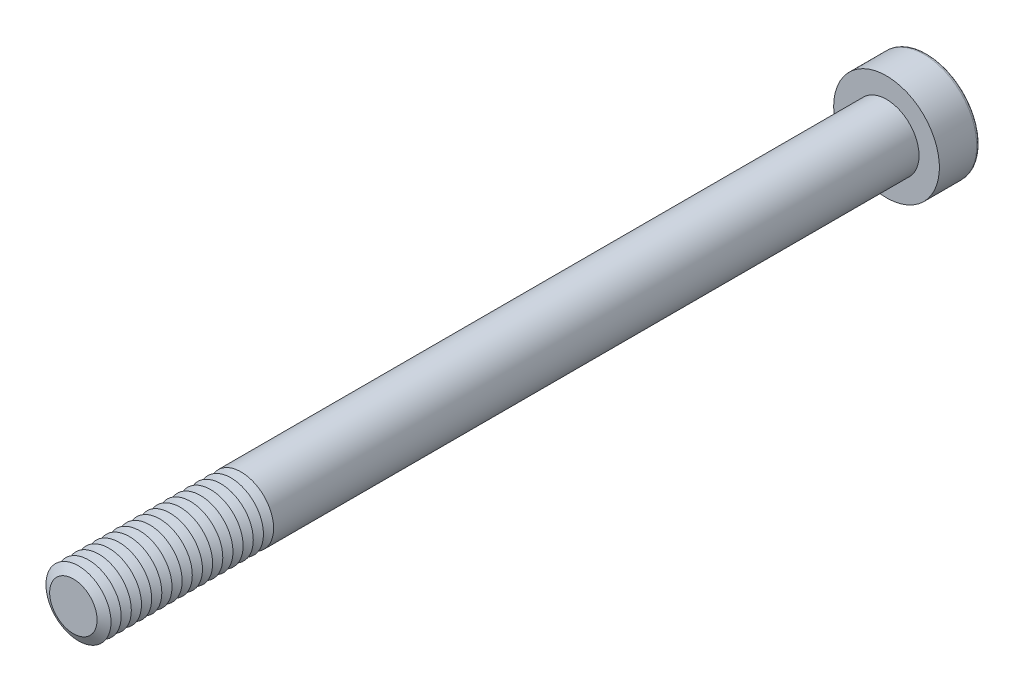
ISO-10303-21;
HEADER;
FILE_DESCRIPTION(('STEP AP214'),'2;1');
FILE_NAME('part.step','',(''),(''),'','','');
FILE_SCHEMA(('AUTOMOTIVE_DESIGN { 1 0 10303 214 1 1 1 1 }'));
ENDSEC;
DATA;
#1=APPLICATION_CONTEXT('core data for automotive mechanical design processes');
#2=APPLICATION_PROTOCOL_DEFINITION('international standard','automotive_design',2000,#1);
#3=PRODUCT_CONTEXT('',#1,'mechanical');
#4=PRODUCT('Part','Part','',(#3));
#5=PRODUCT_RELATED_PRODUCT_CATEGORY('part','',(#4));
#6=PRODUCT_DEFINITION_FORMATION('','',#4);
#7=PRODUCT_DEFINITION_CONTEXT('part definition',#1,'design');
#8=PRODUCT_DEFINITION('design','',#6,#7);
#9=PRODUCT_DEFINITION_SHAPE('','',#8);
#10=(LENGTH_UNIT() NAMED_UNIT(*) SI_UNIT(.MILLI.,.METRE.));
#11=(NAMED_UNIT(*) PLANE_ANGLE_UNIT() SI_UNIT($,.RADIAN.));
#12=(NAMED_UNIT(*) SI_UNIT($,.STERADIAN.) SOLID_ANGLE_UNIT());
#13=UNCERTAINTY_MEASURE_WITH_UNIT(LENGTH_MEASURE(1.E-05),#10,'distance_accuracy_value','');
#14=(GEOMETRIC_REPRESENTATION_CONTEXT(3) GLOBAL_UNCERTAINTY_ASSIGNED_CONTEXT((#13)) GLOBAL_UNIT_ASSIGNED_CONTEXT((#10,
#11,#12)) REPRESENTATION_CONTEXT('',''));
#15=CARTESIAN_POINT('',(0.,0.,0.));
#16=DIRECTION('',(0.,0.,1.));
#17=DIRECTION('',(1.,0.,0.));
#18=AXIS2_PLACEMENT_3D('',#15,#16,#17);
#19=CARTESIAN_POINT('',(0.,0.,95.625));
#20=DIRECTION('',(0.,0.,1.));
#21=DIRECTION('',(1.,0.,0.));
#22=AXIS2_PLACEMENT_3D('',#19,#20,#21);
#23=CONICAL_SURFACE('',#22,4.,1.0471975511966);
#24=CARTESIAN_POINT('',(0.,0.,95.));
#25=DIRECTION('',(0.,0.,1.));
#26=DIRECTION('',(1.,0.,0.));
#27=AXIS2_PLACEMENT_3D('',#24,#25,#26);
#28=CIRCLE('',#27,2.91746824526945);
#29=CARTESIAN_POINT('',(2.91746824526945,0.,95.));
#30=VERTEX_POINT('',#29);
#31=EDGE_CURVE('E312',#30,#30,#28,.T.);
#32=ORIENTED_EDGE('',*,*,#31,.T.);
#33=EDGE_LOOP('',(#32));
#34=FACE_BOUND('',#33,.T.);
#35=CARTESIAN_POINT('',(0.,0.,95.625));
#36=DIRECTION('',(0.,0.,1.));
#37=DIRECTION('',(1.,0.,0.));
#38=AXIS2_PLACEMENT_3D('',#35,#36,#37);
#39=CIRCLE('',#38,4.);
#40=CARTESIAN_POINT('',(4.,0.,95.625));
#41=VERTEX_POINT('',#40);
#42=EDGE_CURVE('E315',#41,#41,#39,.T.);
#43=ORIENTED_EDGE('',*,*,#42,.F.);
#44=EDGE_LOOP('',(#43));
#45=FACE_BOUND('',#44,.T.);
#46=ADVANCED_FACE('F39',(#34,#45),#23,.T.);
#47=CARTESIAN_POINT('',(0.,0.,95.));
#48=DIRECTION('',(0.,0.,-1.));
#49=DIRECTION('',(-1.,0.,0.));
#50=AXIS2_PLACEMENT_3D('',#47,#48,#49);
#51=CONICAL_SURFACE('',#50,2.91746824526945,1.0471975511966);
#52=CARTESIAN_POINT('',(0.,0.,94.375));
#53=DIRECTION('',(0.,0.,1.));
#54=DIRECTION('',(1.,0.,0.));
#55=AXIS2_PLACEMENT_3D('',#52,#53,#54);
#56=CIRCLE('',#55,4.);
#57=CARTESIAN_POINT('',(4.,0.,94.375));
#58=VERTEX_POINT('',#57);
#59=EDGE_CURVE('E323',#58,#58,#56,.T.);
#60=ORIENTED_EDGE('',*,*,#59,.T.);
#61=EDGE_LOOP('',(#60));
#62=FACE_BOUND('',#61,.T.);
#63=ORIENTED_EDGE('',*,*,#31,.F.);
#64=EDGE_LOOP('',(#63));
#65=FACE_BOUND('',#64,.T.);
#66=ADVANCED_FACE('F243',(#62,#65),#51,.T.);
#67=CARTESIAN_POINT('',(0.,0.,100.));
#68=DIRECTION('',(0.,0.,1.));
#69=DIRECTION('',(1.,0.,0.));
#70=AXIS2_PLACEMENT_3D('',#67,#68,#69);
#71=PLANE('',#70);
#72=CARTESIAN_POINT('',(0.,0.,100.));
#73=DIRECTION('',(0.,0.,1.));
#74=DIRECTION('',(1.,0.,0.));
#75=AXIS2_PLACEMENT_3D('',#72,#73,#74);
#76=CIRCLE('',#75,2.91746824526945);
#77=CARTESIAN_POINT('',(2.91746824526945,0.,100.));
#78=VERTEX_POINT('',#77);
#79=EDGE_CURVE('E172',#78,#78,#76,.T.);
#80=ORIENTED_EDGE('',*,*,#79,.T.);
#81=EDGE_LOOP('',(#80));
#82=FACE_BOUND('',#81,.T.);
#83=ADVANCED_FACE('F249',(#82),#71,.T.);
#84=CARTESIAN_POINT('',(0.,0.,100.));
#85=DIRECTION('',(0.,0.,-1.));
#86=DIRECTION('',(-1.,0.,0.));
#87=AXIS2_PLACEMENT_3D('',#84,#85,#86);
#88=CONICAL_SURFACE('',#87,2.91746824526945,1.0471975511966);
#89=CARTESIAN_POINT('',(0.,0.,99.375));
#90=DIRECTION('',(0.,0.,1.));
#91=DIRECTION('',(1.,0.,0.));
#92=AXIS2_PLACEMENT_3D('',#89,#90,#91);
#93=CIRCLE('',#92,4.);
#94=CARTESIAN_POINT('',(4.,0.,99.375));
#95=VERTEX_POINT('',#94);
#96=EDGE_CURVE('E289',#95,#95,#93,.T.);
#97=ORIENTED_EDGE('',*,*,#96,.T.);
#98=EDGE_LOOP('',(#97));
#99=FACE_BOUND('',#98,.T.);
#100=ORIENTED_EDGE('',*,*,#79,.F.);
#101=EDGE_LOOP('',(#100));
#102=FACE_BOUND('',#101,.T.);
#103=ADVANCED_FACE('F197',(#99,#102),#88,.T.);
#104=CARTESIAN_POINT('',(0.,0.,99.375));
#105=DIRECTION('',(0.,0.,1.));
#106=DIRECTION('',(1.,0.,0.));
#107=AXIS2_PLACEMENT_3D('',#104,#105,#106);
#108=CONICAL_SURFACE('',#107,4.,1.0471975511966);
#109=CARTESIAN_POINT('',(0.,0.,98.75));
#110=DIRECTION('',(0.,0.,1.));
#111=DIRECTION('',(1.,0.,0.));
#112=AXIS2_PLACEMENT_3D('',#109,#110,#111);
#113=CIRCLE('',#112,2.91746824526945);
#114=CARTESIAN_POINT('',(2.91746824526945,0.,98.75));
#115=VERTEX_POINT('',#114);
#116=EDGE_CURVE('E286',#115,#115,#113,.T.);
#117=ORIENTED_EDGE('',*,*,#116,.T.);
#118=EDGE_LOOP('',(#117));
#119=FACE_BOUND('',#118,.T.);
#120=ORIENTED_EDGE('',*,*,#96,.F.);
#121=EDGE_LOOP('',(#120));
#122=FACE_BOUND('',#121,.T.);
#123=ADVANCED_FACE('F275',(#119,#122),#108,.T.);
#124=CARTESIAN_POINT('',(0.,0.,98.75));
#125=DIRECTION('',(0.,0.,-1.));
#126=DIRECTION('',(-1.,0.,0.));
#127=AXIS2_PLACEMENT_3D('',#124,#125,#126);
#128=CONICAL_SURFACE('',#127,2.91746824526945,1.0471975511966);
#129=CARTESIAN_POINT('',(0.,0.,98.125));
#130=DIRECTION('',(0.,0.,1.));
#131=DIRECTION('',(1.,0.,0.));
#132=AXIS2_PLACEMENT_3D('',#129,#130,#131);
#133=CIRCLE('',#132,4.);
#134=CARTESIAN_POINT('',(4.,0.,98.125));
#135=VERTEX_POINT('',#134);
#136=EDGE_CURVE('E298',#135,#135,#133,.T.);
#137=ORIENTED_EDGE('',*,*,#136,.T.);
#138=EDGE_LOOP('',(#137));
#139=FACE_BOUND('',#138,.T.);
#140=ORIENTED_EDGE('',*,*,#116,.F.);
#141=EDGE_LOOP('',(#140));
#142=FACE_BOUND('',#141,.T.);
#143=ADVANCED_FACE('F272',(#139,#142),#128,.T.);
#144=CARTESIAN_POINT('',(0.,0.,98.125));
#145=DIRECTION('',(0.,0.,1.));
#146=DIRECTION('',(1.,0.,0.));
#147=AXIS2_PLACEMENT_3D('',#144,#145,#146);
#148=CONICAL_SURFACE('',#147,4.,1.0471975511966);
#149=CARTESIAN_POINT('',(0.,0.,97.5));
#150=DIRECTION('',(0.,0.,1.));
#151=DIRECTION('',(1.,0.,0.));
#152=AXIS2_PLACEMENT_3D('',#149,#150,#151);
#153=CIRCLE('',#152,2.91746824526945);
#154=CARTESIAN_POINT('',(2.91746824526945,0.,97.5));
#155=VERTEX_POINT('',#154);
#156=EDGE_CURVE('E291',#155,#155,#153,.T.);
#157=ORIENTED_EDGE('',*,*,#156,.T.);
#158=EDGE_LOOP('',(#157));
#159=FACE_BOUND('',#158,.T.);
#160=ORIENTED_EDGE('',*,*,#136,.F.);
#161=EDGE_LOOP('',(#160));
#162=FACE_BOUND('',#161,.T.);
#163=ADVANCED_FACE('F268',(#159,#162),#148,.T.);
#164=CARTESIAN_POINT('',(0.,0.,97.5));
#165=DIRECTION('',(0.,0.,-1.));
#166=DIRECTION('',(-1.,0.,0.));
#167=AXIS2_PLACEMENT_3D('',#164,#165,#166);
#168=CONICAL_SURFACE('',#167,2.91746824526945,1.0471975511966);
#169=CARTESIAN_POINT('',(0.,0.,96.875));
#170=DIRECTION('',(0.,0.,1.));
#171=DIRECTION('',(1.,0.,0.));
#172=AXIS2_PLACEMENT_3D('',#169,#170,#171);
#173=CIRCLE('',#172,4.);
#174=CARTESIAN_POINT('',(4.,0.,96.875));
#175=VERTEX_POINT('',#174);
#176=EDGE_CURVE('E308',#175,#175,#173,.T.);
#177=ORIENTED_EDGE('',*,*,#176,.T.);
#178=EDGE_LOOP('',(#177));
#179=FACE_BOUND('',#178,.T.);
#180=ORIENTED_EDGE('',*,*,#156,.F.);
#181=EDGE_LOOP('',(#180));
#182=FACE_BOUND('',#181,.T.);
#183=ADVANCED_FACE('F264',(#179,#182),#168,.T.);
#184=CARTESIAN_POINT('',(0.,0.,96.875));
#185=DIRECTION('',(0.,0.,1.));
#186=DIRECTION('',(1.,0.,0.));
#187=AXIS2_PLACEMENT_3D('',#184,#185,#186);
#188=CONICAL_SURFACE('',#187,4.,1.0471975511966);
#189=CARTESIAN_POINT('',(0.,0.,96.25));
#190=DIRECTION('',(0.,0.,1.));
#191=DIRECTION('',(1.,0.,0.));
#192=AXIS2_PLACEMENT_3D('',#189,#190,#191);
#193=CIRCLE('',#192,2.91746824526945);
#194=CARTESIAN_POINT('',(2.91746824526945,0.,96.25));
#195=VERTEX_POINT('',#194);
#196=EDGE_CURVE('E304',#195,#195,#193,.T.);
#197=ORIENTED_EDGE('',*,*,#196,.T.);
#198=EDGE_LOOP('',(#197));
#199=FACE_BOUND('',#198,.T.);
#200=ORIENTED_EDGE('',*,*,#176,.F.);
#201=EDGE_LOOP('',(#200));
#202=FACE_BOUND('',#201,.T.);
#203=ADVANCED_FACE('F260',(#199,#202),#188,.T.);
#204=CARTESIAN_POINT('',(0.,0.,96.25));
#205=DIRECTION('',(0.,0.,-1.));
#206=DIRECTION('',(-1.,0.,0.));
#207=AXIS2_PLACEMENT_3D('',#204,#205,#206);
#208=CONICAL_SURFACE('',#207,2.91746824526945,1.0471975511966);
#209=ORIENTED_EDGE('',*,*,#42,.T.);
#210=EDGE_LOOP('',(#209));
#211=FACE_BOUND('',#210,.T.);
#212=ORIENTED_EDGE('',*,*,#196,.F.);
#213=EDGE_LOOP('',(#212));
#214=FACE_BOUND('',#213,.T.);
#215=ADVANCED_FACE('F256',(#211,#214),#208,.T.);
#216=CARTESIAN_POINT('',(0.,0.,94.375));
#217=DIRECTION('',(0.,0.,1.));
#218=DIRECTION('',(1.,0.,0.));
#219=AXIS2_PLACEMENT_3D('',#216,#217,#218);
#220=CONICAL_SURFACE('',#219,4.,1.0471975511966);
#221=CARTESIAN_POINT('',(0.,0.,93.75));
#222=DIRECTION('',(0.,0.,1.));
#223=DIRECTION('',(1.,0.,0.));
#224=AXIS2_PLACEMENT_3D('',#221,#222,#223);
#225=CIRCLE('',#224,2.91746824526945);
#226=CARTESIAN_POINT('',(2.91746824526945,0.,93.75));
#227=VERTEX_POINT('',#226);
#228=EDGE_CURVE('E319',#227,#227,#225,.T.);
#229=ORIENTED_EDGE('',*,*,#228,.T.);
#230=EDGE_LOOP('',(#229));
#231=FACE_BOUND('',#230,.T.);
#232=ORIENTED_EDGE('',*,*,#59,.F.);
#233=EDGE_LOOP('',(#232));
#234=FACE_BOUND('',#233,.T.);
#235=ADVANCED_FACE('F259',(#231,#234),#220,.T.);
#236=CARTESIAN_POINT('',(0.,0.,93.75));
#237=DIRECTION('',(0.,0.,-1.));
#238=DIRECTION('',(-1.,0.,0.));
#239=AXIS2_PLACEMENT_3D('',#236,#237,#238);
#240=CONICAL_SURFACE('',#239,2.91746824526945,1.0471975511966);
#241=CARTESIAN_POINT('',(0.,0.,93.125));
#242=DIRECTION('',(0.,0.,1.));
#243=DIRECTION('',(1.,0.,0.));
#244=AXIS2_PLACEMENT_3D('',#241,#242,#243);
#245=CIRCLE('',#244,4.);
#246=CARTESIAN_POINT('',(4.,0.,93.125));
#247=VERTEX_POINT('',#246);
#248=EDGE_CURVE('E331',#247,#247,#245,.T.);
#249=ORIENTED_EDGE('',*,*,#248,.T.);
#250=EDGE_LOOP('',(#249));
#251=FACE_BOUND('',#250,.T.);
#252=ORIENTED_EDGE('',*,*,#228,.F.);
#253=EDGE_LOOP('',(#252));
#254=FACE_BOUND('',#253,.T.);
#255=ADVANCED_FACE('F510',(#251,#254),#240,.T.);
#256=CARTESIAN_POINT('',(0.,0.,93.125));
#257=DIRECTION('',(0.,0.,1.));
#258=DIRECTION('',(1.,0.,0.));
#259=AXIS2_PLACEMENT_3D('',#256,#257,#258);
#260=CONICAL_SURFACE('',#259,4.,1.0471975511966);
#261=CARTESIAN_POINT('',(0.,0.,92.5));
#262=DIRECTION('',(0.,0.,1.));
#263=DIRECTION('',(1.,0.,0.));
#264=AXIS2_PLACEMENT_3D('',#261,#262,#263);
#265=CIRCLE('',#264,2.91746824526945);
#266=CARTESIAN_POINT('',(2.91746824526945,0.,92.5));
#267=VERTEX_POINT('',#266);
#268=EDGE_CURVE('E327',#267,#267,#265,.T.);
#269=ORIENTED_EDGE('',*,*,#268,.T.);
#270=EDGE_LOOP('',(#269));
#271=FACE_BOUND('',#270,.T.);
#272=ORIENTED_EDGE('',*,*,#248,.F.);
#273=EDGE_LOOP('',(#272));
#274=FACE_BOUND('',#273,.T.);
#275=ADVANCED_FACE('F506',(#271,#274),#260,.T.);
#276=CARTESIAN_POINT('',(0.,0.,92.5));
#277=DIRECTION('',(0.,0.,-1.));
#278=DIRECTION('',(-1.,0.,0.));
#279=AXIS2_PLACEMENT_3D('',#276,#277,#278);
#280=CONICAL_SURFACE('',#279,2.91746824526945,1.0471975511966);
#281=CARTESIAN_POINT('',(0.,0.,91.875));
#282=DIRECTION('',(0.,0.,1.));
#283=DIRECTION('',(1.,0.,0.));
#284=AXIS2_PLACEMENT_3D('',#281,#282,#283);
#285=CIRCLE('',#284,4.);
#286=CARTESIAN_POINT('',(4.,0.,91.875));
#287=VERTEX_POINT('',#286);
#288=EDGE_CURVE('E339',#287,#287,#285,.T.);
#289=ORIENTED_EDGE('',*,*,#288,.T.);
#290=EDGE_LOOP('',(#289));
#291=FACE_BOUND('',#290,.T.);
#292=ORIENTED_EDGE('',*,*,#268,.F.);
#293=EDGE_LOOP('',(#292));
#294=FACE_BOUND('',#293,.T.);
#295=ADVANCED_FACE('F502',(#291,#294),#280,.T.);
#296=CARTESIAN_POINT('',(0.,0.,91.875));
#297=DIRECTION('',(0.,0.,1.));
#298=DIRECTION('',(1.,0.,0.));
#299=AXIS2_PLACEMENT_3D('',#296,#297,#298);
#300=CONICAL_SURFACE('',#299,4.,1.0471975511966);
#301=CARTESIAN_POINT('',(0.,0.,91.25));
#302=DIRECTION('',(0.,0.,1.));
#303=DIRECTION('',(1.,0.,0.));
#304=AXIS2_PLACEMENT_3D('',#301,#302,#303);
#305=CIRCLE('',#304,2.91746824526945);
#306=CARTESIAN_POINT('',(2.91746824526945,0.,91.25));
#307=VERTEX_POINT('',#306);
#308=EDGE_CURVE('E335',#307,#307,#305,.T.);
#309=ORIENTED_EDGE('',*,*,#308,.T.);
#310=EDGE_LOOP('',(#309));
#311=FACE_BOUND('',#310,.T.);
#312=ORIENTED_EDGE('',*,*,#288,.F.);
#313=EDGE_LOOP('',(#312));
#314=FACE_BOUND('',#313,.T.);
#315=ADVANCED_FACE('F498',(#311,#314),#300,.T.);
#316=CARTESIAN_POINT('',(0.,0.,91.25));
#317=DIRECTION('',(0.,0.,-1.));
#318=DIRECTION('',(-1.,0.,0.));
#319=AXIS2_PLACEMENT_3D('',#316,#317,#318);
#320=CONICAL_SURFACE('',#319,2.91746824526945,1.0471975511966);
#321=CARTESIAN_POINT('',(0.,0.,90.625));
#322=DIRECTION('',(0.,0.,1.));
#323=DIRECTION('',(1.,0.,0.));
#324=AXIS2_PLACEMENT_3D('',#321,#322,#323);
#325=CIRCLE('',#324,4.);
#326=CARTESIAN_POINT('',(4.,0.,90.625));
#327=VERTEX_POINT('',#326);
#328=EDGE_CURVE('E347',#327,#327,#325,.T.);
#329=ORIENTED_EDGE('',*,*,#328,.T.);
#330=EDGE_LOOP('',(#329));
#331=FACE_BOUND('',#330,.T.);
#332=ORIENTED_EDGE('',*,*,#308,.F.);
#333=EDGE_LOOP('',(#332));
#334=FACE_BOUND('',#333,.T.);
#335=ADVANCED_FACE('F494',(#331,#334),#320,.T.);
#336=CARTESIAN_POINT('',(0.,0.,90.625));
#337=DIRECTION('',(0.,0.,1.));
#338=DIRECTION('',(1.,0.,0.));
#339=AXIS2_PLACEMENT_3D('',#336,#337,#338);
#340=CONICAL_SURFACE('',#339,4.,1.0471975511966);
#341=CARTESIAN_POINT('',(0.,0.,90.));
#342=DIRECTION('',(0.,0.,1.));
#343=DIRECTION('',(1.,0.,0.));
#344=AXIS2_PLACEMENT_3D('',#341,#342,#343);
#345=CIRCLE('',#344,2.91746824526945);
#346=CARTESIAN_POINT('',(2.91746824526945,0.,90.));
#347=VERTEX_POINT('',#346);
#348=EDGE_CURVE('E343',#347,#347,#345,.T.);
#349=ORIENTED_EDGE('',*,*,#348,.T.);
#350=EDGE_LOOP('',(#349));
#351=FACE_BOUND('',#350,.T.);
#352=ORIENTED_EDGE('',*,*,#328,.F.);
#353=EDGE_LOOP('',(#352));
#354=FACE_BOUND('',#353,.T.);
#355=ADVANCED_FACE('F490',(#351,#354),#340,.T.);
#356=CARTESIAN_POINT('',(0.,0.,90.));
#357=DIRECTION('',(0.,0.,-1.));
#358=DIRECTION('',(-1.,0.,0.));
#359=AXIS2_PLACEMENT_3D('',#356,#357,#358);
#360=CONICAL_SURFACE('',#359,2.91746824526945,1.0471975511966);
#361=CARTESIAN_POINT('',(0.,0.,89.375));
#362=DIRECTION('',(0.,0.,1.));
#363=DIRECTION('',(1.,0.,0.));
#364=AXIS2_PLACEMENT_3D('',#361,#362,#363);
#365=CIRCLE('',#364,4.);
#366=CARTESIAN_POINT('',(4.,0.,89.375));
#367=VERTEX_POINT('',#366);
#368=EDGE_CURVE('E355',#367,#367,#365,.T.);
#369=ORIENTED_EDGE('',*,*,#368,.T.);
#370=EDGE_LOOP('',(#369));
#371=FACE_BOUND('',#370,.T.);
#372=ORIENTED_EDGE('',*,*,#348,.F.);
#373=EDGE_LOOP('',(#372));
#374=FACE_BOUND('',#373,.T.);
#375=ADVANCED_FACE('F486',(#371,#374),#360,.T.);
#376=CARTESIAN_POINT('',(0.,0.,89.375));
#377=DIRECTION('',(0.,0.,1.));
#378=DIRECTION('',(1.,0.,0.));
#379=AXIS2_PLACEMENT_3D('',#376,#377,#378);
#380=CONICAL_SURFACE('',#379,4.,1.0471975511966);
#381=CARTESIAN_POINT('',(0.,0.,88.75));
#382=DIRECTION('',(0.,0.,1.));
#383=DIRECTION('',(1.,0.,0.));
#384=AXIS2_PLACEMENT_3D('',#381,#382,#383);
#385=CIRCLE('',#384,2.91746824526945);
#386=CARTESIAN_POINT('',(2.91746824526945,0.,88.75));
#387=VERTEX_POINT('',#386);
#388=EDGE_CURVE('E351',#387,#387,#385,.T.);
#389=ORIENTED_EDGE('',*,*,#388,.T.);
#390=EDGE_LOOP('',(#389));
#391=FACE_BOUND('',#390,.T.);
#392=ORIENTED_EDGE('',*,*,#368,.F.);
#393=EDGE_LOOP('',(#392));
#394=FACE_BOUND('',#393,.T.);
#395=ADVANCED_FACE('F482',(#391,#394),#380,.T.);
#396=CARTESIAN_POINT('',(0.,0.,88.75));
#397=DIRECTION('',(0.,0.,-1.));
#398=DIRECTION('',(-1.,0.,0.));
#399=AXIS2_PLACEMENT_3D('',#396,#397,#398);
#400=CONICAL_SURFACE('',#399,2.91746824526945,1.0471975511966);
#401=CARTESIAN_POINT('',(0.,0.,88.125));
#402=DIRECTION('',(0.,0.,1.));
#403=DIRECTION('',(1.,0.,0.));
#404=AXIS2_PLACEMENT_3D('',#401,#402,#403);
#405=CIRCLE('',#404,4.);
#406=CARTESIAN_POINT('',(4.,0.,88.125));
#407=VERTEX_POINT('',#406);
#408=EDGE_CURVE('E363',#407,#407,#405,.T.);
#409=ORIENTED_EDGE('',*,*,#408,.T.);
#410=EDGE_LOOP('',(#409));
#411=FACE_BOUND('',#410,.T.);
#412=ORIENTED_EDGE('',*,*,#388,.F.);
#413=EDGE_LOOP('',(#412));
#414=FACE_BOUND('',#413,.T.);
#415=ADVANCED_FACE('F478',(#411,#414),#400,.T.);
#416=CARTESIAN_POINT('',(0.,0.,88.125));
#417=DIRECTION('',(0.,0.,1.));
#418=DIRECTION('',(1.,0.,0.));
#419=AXIS2_PLACEMENT_3D('',#416,#417,#418);
#420=CONICAL_SURFACE('',#419,4.,1.0471975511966);
#421=CARTESIAN_POINT('',(0.,0.,87.5));
#422=DIRECTION('',(0.,0.,1.));
#423=DIRECTION('',(1.,0.,0.));
#424=AXIS2_PLACEMENT_3D('',#421,#422,#423);
#425=CIRCLE('',#424,2.91746824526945);
#426=CARTESIAN_POINT('',(2.91746824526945,0.,87.5));
#427=VERTEX_POINT('',#426);
#428=EDGE_CURVE('E359',#427,#427,#425,.T.);
#429=ORIENTED_EDGE('',*,*,#428,.T.);
#430=EDGE_LOOP('',(#429));
#431=FACE_BOUND('',#430,.T.);
#432=ORIENTED_EDGE('',*,*,#408,.F.);
#433=EDGE_LOOP('',(#432));
#434=FACE_BOUND('',#433,.T.);
#435=ADVANCED_FACE('F474',(#431,#434),#420,.T.);
#436=CARTESIAN_POINT('',(0.,0.,87.5));
#437=DIRECTION('',(0.,0.,-1.));
#438=DIRECTION('',(-1.,0.,0.));
#439=AXIS2_PLACEMENT_3D('',#436,#437,#438);
#440=CONICAL_SURFACE('',#439,2.91746824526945,1.0471975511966);
#441=CARTESIAN_POINT('',(0.,0.,86.875));
#442=DIRECTION('',(0.,0.,1.));
#443=DIRECTION('',(1.,0.,0.));
#444=AXIS2_PLACEMENT_3D('',#441,#442,#443);
#445=CIRCLE('',#444,4.);
#446=CARTESIAN_POINT('',(4.,0.,86.875));
#447=VERTEX_POINT('',#446);
#448=EDGE_CURVE('E371',#447,#447,#445,.T.);
#449=ORIENTED_EDGE('',*,*,#448,.T.);
#450=EDGE_LOOP('',(#449));
#451=FACE_BOUND('',#450,.T.);
#452=ORIENTED_EDGE('',*,*,#428,.F.);
#453=EDGE_LOOP('',(#452));
#454=FACE_BOUND('',#453,.T.);
#455=ADVANCED_FACE('F470',(#451,#454),#440,.T.);
#456=CARTESIAN_POINT('',(0.,0.,86.875));
#457=DIRECTION('',(0.,0.,1.));
#458=DIRECTION('',(1.,0.,0.));
#459=AXIS2_PLACEMENT_3D('',#456,#457,#458);
#460=CONICAL_SURFACE('',#459,4.,1.0471975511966);
#461=CARTESIAN_POINT('',(0.,0.,86.25));
#462=DIRECTION('',(0.,0.,1.));
#463=DIRECTION('',(1.,0.,0.));
#464=AXIS2_PLACEMENT_3D('',#461,#462,#463);
#465=CIRCLE('',#464,2.91746824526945);
#466=CARTESIAN_POINT('',(2.91746824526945,0.,86.25));
#467=VERTEX_POINT('',#466);
#468=EDGE_CURVE('E367',#467,#467,#465,.T.);
#469=ORIENTED_EDGE('',*,*,#468,.T.);
#470=EDGE_LOOP('',(#469));
#471=FACE_BOUND('',#470,.T.);
#472=ORIENTED_EDGE('',*,*,#448,.F.);
#473=EDGE_LOOP('',(#472));
#474=FACE_BOUND('',#473,.T.);
#475=ADVANCED_FACE('F466',(#471,#474),#460,.T.);
#476=CARTESIAN_POINT('',(0.,0.,86.25));
#477=DIRECTION('',(0.,0.,-1.));
#478=DIRECTION('',(-1.,0.,0.));
#479=AXIS2_PLACEMENT_3D('',#476,#477,#478);
#480=CONICAL_SURFACE('',#479,2.91746824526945,1.0471975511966);
#481=CARTESIAN_POINT('',(0.,0.,85.625));
#482=DIRECTION('',(0.,0.,1.));
#483=DIRECTION('',(1.,0.,0.));
#484=AXIS2_PLACEMENT_3D('',#481,#482,#483);
#485=CIRCLE('',#484,4.);
#486=CARTESIAN_POINT('',(4.,0.,85.625));
#487=VERTEX_POINT('',#486);
#488=EDGE_CURVE('E379',#487,#487,#485,.T.);
#489=ORIENTED_EDGE('',*,*,#488,.T.);
#490=EDGE_LOOP('',(#489));
#491=FACE_BOUND('',#490,.T.);
#492=ORIENTED_EDGE('',*,*,#468,.F.);
#493=EDGE_LOOP('',(#492));
#494=FACE_BOUND('',#493,.T.);
#495=ADVANCED_FACE('F462',(#491,#494),#480,.T.);
#496=CARTESIAN_POINT('',(0.,0.,85.625));
#497=DIRECTION('',(0.,0.,1.));
#498=DIRECTION('',(1.,0.,0.));
#499=AXIS2_PLACEMENT_3D('',#496,#497,#498);
#500=CONICAL_SURFACE('',#499,4.,1.0471975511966);
#501=CARTESIAN_POINT('',(0.,0.,85.));
#502=DIRECTION('',(0.,0.,1.));
#503=DIRECTION('',(1.,0.,0.));
#504=AXIS2_PLACEMENT_3D('',#501,#502,#503);
#505=CIRCLE('',#504,2.91746824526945);
#506=CARTESIAN_POINT('',(2.91746824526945,0.,85.));
#507=VERTEX_POINT('',#506);
#508=EDGE_CURVE('E375',#507,#507,#505,.T.);
#509=ORIENTED_EDGE('',*,*,#508,.T.);
#510=EDGE_LOOP('',(#509));
#511=FACE_BOUND('',#510,.T.);
#512=ORIENTED_EDGE('',*,*,#488,.F.);
#513=EDGE_LOOP('',(#512));
#514=FACE_BOUND('',#513,.T.);
#515=ADVANCED_FACE('F458',(#511,#514),#500,.T.);
#516=CARTESIAN_POINT('',(0.,0.,85.));
#517=DIRECTION('',(0.,0.,-1.));
#518=DIRECTION('',(-1.,0.,0.));
#519=AXIS2_PLACEMENT_3D('',#516,#517,#518);
#520=CONICAL_SURFACE('',#519,2.91746824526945,1.0471975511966);
#521=CARTESIAN_POINT('',(0.,0.,84.375));
#522=DIRECTION('',(0.,0.,1.));
#523=DIRECTION('',(1.,0.,0.));
#524=AXIS2_PLACEMENT_3D('',#521,#522,#523);
#525=CIRCLE('',#524,4.);
#526=CARTESIAN_POINT('',(4.,0.,84.375));
#527=VERTEX_POINT('',#526);
#528=EDGE_CURVE('E387',#527,#527,#525,.T.);
#529=ORIENTED_EDGE('',*,*,#528,.T.);
#530=EDGE_LOOP('',(#529));
#531=FACE_BOUND('',#530,.T.);
#532=ORIENTED_EDGE('',*,*,#508,.F.);
#533=EDGE_LOOP('',(#532));
#534=FACE_BOUND('',#533,.T.);
#535=ADVANCED_FACE('F454',(#531,#534),#520,.T.);
#536=CARTESIAN_POINT('',(0.,0.,84.375));
#537=DIRECTION('',(0.,0.,1.));
#538=DIRECTION('',(1.,0.,0.));
#539=AXIS2_PLACEMENT_3D('',#536,#537,#538);
#540=CONICAL_SURFACE('',#539,4.,1.0471975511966);
#541=CARTESIAN_POINT('',(0.,0.,83.75));
#542=DIRECTION('',(0.,0.,1.));
#543=DIRECTION('',(1.,0.,0.));
#544=AXIS2_PLACEMENT_3D('',#541,#542,#543);
#545=CIRCLE('',#544,2.91746824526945);
#546=CARTESIAN_POINT('',(2.91746824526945,0.,83.75));
#547=VERTEX_POINT('',#546);
#548=EDGE_CURVE('E383',#547,#547,#545,.T.);
#549=ORIENTED_EDGE('',*,*,#548,.T.);
#550=EDGE_LOOP('',(#549));
#551=FACE_BOUND('',#550,.T.);
#552=ORIENTED_EDGE('',*,*,#528,.F.);
#553=EDGE_LOOP('',(#552));
#554=FACE_BOUND('',#553,.T.);
#555=ADVANCED_FACE('F450',(#551,#554),#540,.T.);
#556=CARTESIAN_POINT('',(0.,0.,83.75));
#557=DIRECTION('',(0.,0.,-1.));
#558=DIRECTION('',(-1.,0.,0.));
#559=AXIS2_PLACEMENT_3D('',#556,#557,#558);
#560=CONICAL_SURFACE('',#559,2.91746824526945,1.0471975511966);
#561=CARTESIAN_POINT('',(0.,0.,83.125));
#562=DIRECTION('',(0.,0.,1.));
#563=DIRECTION('',(1.,0.,0.));
#564=AXIS2_PLACEMENT_3D('',#561,#562,#563);
#565=CIRCLE('',#564,4.);
#566=CARTESIAN_POINT('',(4.,0.,83.125));
#567=VERTEX_POINT('',#566);
#568=EDGE_CURVE('E394',#567,#567,#565,.T.);
#569=ORIENTED_EDGE('',*,*,#568,.T.);
#570=EDGE_LOOP('',(#569));
#571=FACE_BOUND('',#570,.T.);
#572=ORIENTED_EDGE('',*,*,#548,.F.);
#573=EDGE_LOOP('',(#572));
#574=FACE_BOUND('',#573,.T.);
#575=ADVANCED_FACE('F446',(#571,#574),#560,.T.);
#576=CARTESIAN_POINT('',(0.,0.,83.125));
#577=DIRECTION('',(0.,0.,1.));
#578=DIRECTION('',(1.,0.,0.));
#579=AXIS2_PLACEMENT_3D('',#576,#577,#578);
#580=CONICAL_SURFACE('',#579,4.,1.0471975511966);
#581=CARTESIAN_POINT('',(0.,0.,82.5));
#582=DIRECTION('',(0.,0.,1.));
#583=DIRECTION('',(1.,0.,0.));
#584=AXIS2_PLACEMENT_3D('',#581,#582,#583);
#585=CIRCLE('',#584,2.91746824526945);
#586=CARTESIAN_POINT('',(2.91746824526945,0.,82.5));
#587=VERTEX_POINT('',#586);
#588=EDGE_CURVE('E391',#587,#587,#585,.T.);
#589=ORIENTED_EDGE('',*,*,#588,.T.);
#590=EDGE_LOOP('',(#589));
#591=FACE_BOUND('',#590,.T.);
#592=ORIENTED_EDGE('',*,*,#568,.F.);
#593=EDGE_LOOP('',(#592));
#594=FACE_BOUND('',#593,.T.);
#595=ADVANCED_FACE('F442',(#591,#594),#580,.T.);
#596=CARTESIAN_POINT('',(0.,0.,82.5));
#597=DIRECTION('',(0.,0.,-1.));
#598=DIRECTION('',(-1.,0.,0.));
#599=AXIS2_PLACEMENT_3D('',#596,#597,#598);
#600=CONICAL_SURFACE('',#599,2.91746824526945,1.0471975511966);
#601=CARTESIAN_POINT('',(0.,0.,81.875));
#602=DIRECTION('',(0.,0.,1.));
#603=DIRECTION('',(1.,0.,0.));
#604=AXIS2_PLACEMENT_3D('',#601,#602,#603);
#605=CIRCLE('',#604,4.);
#606=CARTESIAN_POINT('',(4.,0.,81.875));
#607=VERTEX_POINT('',#606);
#608=EDGE_CURVE('E402',#607,#607,#605,.T.);
#609=ORIENTED_EDGE('',*,*,#608,.T.);
#610=EDGE_LOOP('',(#609));
#611=FACE_BOUND('',#610,.T.);
#612=ORIENTED_EDGE('',*,*,#588,.F.);
#613=EDGE_LOOP('',(#612));
#614=FACE_BOUND('',#613,.T.);
#615=ADVANCED_FACE('F438',(#611,#614),#600,.T.);
#616=CARTESIAN_POINT('',(0.,0.,81.875));
#617=DIRECTION('',(0.,0.,1.));
#618=DIRECTION('',(1.,0.,0.));
#619=AXIS2_PLACEMENT_3D('',#616,#617,#618);
#620=CONICAL_SURFACE('',#619,4.,1.0471975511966);
#621=CARTESIAN_POINT('',(0.,0.,81.25));
#622=DIRECTION('',(0.,0.,1.));
#623=DIRECTION('',(1.,0.,0.));
#624=AXIS2_PLACEMENT_3D('',#621,#622,#623);
#625=CIRCLE('',#624,2.91746824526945);
#626=CARTESIAN_POINT('',(2.91746824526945,0.,81.25));
#627=VERTEX_POINT('',#626);
#628=EDGE_CURVE('E398',#627,#627,#625,.T.);
#629=ORIENTED_EDGE('',*,*,#628,.T.);
#630=EDGE_LOOP('',(#629));
#631=FACE_BOUND('',#630,.T.);
#632=ORIENTED_EDGE('',*,*,#608,.F.);
#633=EDGE_LOOP('',(#632));
#634=FACE_BOUND('',#633,.T.);
#635=ADVANCED_FACE('F433',(#631,#634),#620,.T.);
#636=CARTESIAN_POINT('',(0.,0.,81.25));
#637=DIRECTION('',(0.,0.,-1.));
#638=DIRECTION('',(-1.,0.,0.));
#639=AXIS2_PLACEMENT_3D('',#636,#637,#638);
#640=CONICAL_SURFACE('',#639,2.91746824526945,1.0471975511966);
#641=CARTESIAN_POINT('',(0.,0.,80.625));
#642=DIRECTION('',(0.,0.,1.));
#643=DIRECTION('',(1.,0.,0.));
#644=AXIS2_PLACEMENT_3D('',#641,#642,#643);
#645=CIRCLE('',#644,4.);
#646=CARTESIAN_POINT('',(4.,0.,80.625));
#647=VERTEX_POINT('',#646);
#648=EDGE_CURVE('E414',#647,#647,#645,.T.);
#649=ORIENTED_EDGE('',*,*,#648,.T.);
#650=EDGE_LOOP('',(#649));
#651=FACE_BOUND('',#650,.T.);
#652=ORIENTED_EDGE('',*,*,#628,.F.);
#653=EDGE_LOOP('',(#652));
#654=FACE_BOUND('',#653,.T.);
#655=ADVANCED_FACE('F419',(#651,#654),#640,.T.);
#656=CARTESIAN_POINT('',(0.,0.,80.625));
#657=DIRECTION('',(0.,0.,1.));
#658=DIRECTION('',(1.,0.,0.));
#659=AXIS2_PLACEMENT_3D('',#656,#657,#658);
#660=CONICAL_SURFACE('',#659,4.,1.0471975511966);
#661=CARTESIAN_POINT('',(0.,0.,80.));
#662=DIRECTION('',(0.,0.,1.));
#663=DIRECTION('',(1.,0.,0.));
#664=AXIS2_PLACEMENT_3D('',#661,#662,#663);
#665=CIRCLE('',#664,2.91746824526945);
#666=CARTESIAN_POINT('',(2.91746824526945,0.,80.));
#667=VERTEX_POINT('',#666);
#668=EDGE_CURVE('E406',#667,#667,#665,.T.);
#669=ORIENTED_EDGE('',*,*,#668,.T.);
#670=EDGE_LOOP('',(#669));
#671=FACE_BOUND('',#670,.T.);
#672=ORIENTED_EDGE('',*,*,#648,.F.);
#673=EDGE_LOOP('',(#672));
#674=FACE_BOUND('',#673,.T.);
#675=ADVANCED_FACE('F422',(#671,#674),#660,.T.);
#676=CARTESIAN_POINT('',(0.,0.,80.));
#677=DIRECTION('',(0.,0.,-1.));
#678=DIRECTION('',(-1.,0.,0.));
#679=AXIS2_PLACEMENT_3D('',#676,#677,#678);
#680=CONICAL_SURFACE('',#679,2.91746824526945,1.0471975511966);
#681=CARTESIAN_POINT('',(0.,0.,79.375));
#682=DIRECTION('',(0.,0.,1.));
#683=DIRECTION('',(1.,0.,0.));
#684=AXIS2_PLACEMENT_3D('',#681,#682,#683);
#685=CIRCLE('',#684,4.);
#686=CARTESIAN_POINT('',(4.,0.,79.375));
#687=VERTEX_POINT('',#686);
#688=EDGE_CURVE('E410',#687,#687,#685,.T.);
#689=ORIENTED_EDGE('',*,*,#688,.T.);
#690=EDGE_LOOP('',(#689));
#691=FACE_BOUND('',#690,.T.);
#692=ORIENTED_EDGE('',*,*,#668,.F.);
#693=EDGE_LOOP('',(#692));
#694=FACE_BOUND('',#693,.T.);
#695=ADVANCED_FACE('F424',(#691,#694),#680,.T.);
#696=CARTESIAN_POINT('',(0.,0.,-1.25));
#697=DIRECTION('',(0.,0.,-1.));
#698=DIRECTION('',(-1.,0.,0.));
#699=AXIS2_PLACEMENT_3D('',#696,#697,#698);
#700=CONICAL_SURFACE('',#699,2.5,1.0471975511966);
#701=CARTESIAN_POINT('',(0.,0.,0.193375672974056));
#702=VERTEX_POINT('',#701);
#703=VERTEX_LOOP('',#702);
#704=FACE_BOUND('',#703,.T.);
#705=CARTESIAN_POINT('',(0.,0.,-1.25));
#706=DIRECTION('',(0.,0.,-1.));
#707=DIRECTION('',(-1.,0.,0.));
#708=AXIS2_PLACEMENT_3D('',#705,#706,#707);
#709=CIRCLE('',#708,2.5);
#710=CARTESIAN_POINT('',(-2.1650635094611,1.25,-1.25));
#711=VERTEX_POINT('',#710);
#712=CARTESIAN_POINT('',(0.,2.5,-1.25));
#713=VERTEX_POINT('',#712);
#714=EDGE_CURVE('E149',#711,#713,#709,.T.);
#715=ORIENTED_EDGE('',*,*,#714,.T.);
#716=CARTESIAN_POINT('',(0.,0.,-1.25));
#717=DIRECTION('',(0.,0.,-1.));
#718=DIRECTION('',(-1.,0.,0.));
#719=AXIS2_PLACEMENT_3D('',#716,#717,#718);
#720=CIRCLE('',#719,2.5);
#721=CARTESIAN_POINT('',(2.1650635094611,1.25,-1.25));
#722=VERTEX_POINT('',#721);
#723=EDGE_CURVE('E54',#713,#722,#720,.T.);
#724=ORIENTED_EDGE('',*,*,#723,.T.);
#725=CARTESIAN_POINT('',(2.1650635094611,-1.25,-1.25));
#726=VERTEX_POINT('',#725);
#727=EDGE_CURVE('E1027',#722,#726,#720,.T.);
#728=ORIENTED_EDGE('',*,*,#727,.T.);
#729=CARTESIAN_POINT('',(0.,-2.5,-1.25));
#730=VERTEX_POINT('',#729);
#731=EDGE_CURVE('E1026',#726,#730,#720,.T.);
#732=ORIENTED_EDGE('',*,*,#731,.T.);
#733=CARTESIAN_POINT('',(-2.1650635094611,-1.25,-1.25));
#734=VERTEX_POINT('',#733);
#735=EDGE_CURVE('E1019',#730,#734,#720,.T.);
#736=ORIENTED_EDGE('',*,*,#735,.T.);
#737=EDGE_CURVE('E1017',#734,#711,#720,.T.);
#738=ORIENTED_EDGE('',*,*,#737,.T.);
#739=EDGE_LOOP('',(#715,#724,#728,#732,#736,#738));
#740=FACE_BOUND('',#739,.T.);
#741=ADVANCED_FACE('F199',(#704,#740),#700,.F.);
#742=CARTESIAN_POINT('',(0.,0.,-1.25));
#743=DIRECTION('',(0.,0.,-1.));
#744=DIRECTION('',(-1.,0.,0.));
#745=AXIS2_PLACEMENT_3D('',#742,#743,#744);
#746=PLANE('',#745);
#747=ORIENTED_EDGE('',*,*,#723,.F.);
#748=DIRECTION('',(1.,0.,0.));
#749=VECTOR('',#748,1.);
#750=CARTESIAN_POINT('',(-1.44337567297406,2.5,-1.25));
#751=LINE('',#750,#749);
#752=CARTESIAN_POINT('',(1.44337567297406,2.5,-1.25));
#753=VERTEX_POINT('',#752);
#754=EDGE_CURVE('E1070',#713,#753,#751,.T.);
#755=ORIENTED_EDGE('',*,*,#754,.T.);
#756=DIRECTION('',(0.5,-0.866025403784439,0.));
#757=VECTOR('',#756,1.);
#758=CARTESIAN_POINT('',(1.44337567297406,2.5,-1.25));
#759=LINE('',#758,#757);
#760=EDGE_CURVE('E155',#753,#722,#759,.T.);
#761=ORIENTED_EDGE('',*,*,#760,.T.);
#762=EDGE_LOOP('',(#747,#755,#761));
#763=FACE_BOUND('',#762,.T.);
#764=ADVANCED_FACE('F605',(#763),#746,.T.);
#765=ORIENTED_EDGE('',*,*,#727,.F.);
#766=CARTESIAN_POINT('',(2.88675134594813,0.,-1.25));
#767=VERTEX_POINT('',#766);
#768=EDGE_CURVE('E1064',#722,#767,#759,.T.);
#769=ORIENTED_EDGE('',*,*,#768,.T.);
#770=DIRECTION('',(-0.5,-0.866025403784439,0.));
#771=VECTOR('',#770,1.);
#772=CARTESIAN_POINT('',(2.88675134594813,0.,-1.25));
#773=LINE('',#772,#771);
#774=EDGE_CURVE('E1039',#767,#726,#773,.T.);
#775=ORIENTED_EDGE('',*,*,#774,.T.);
#776=EDGE_LOOP('',(#765,#769,#775));
#777=FACE_BOUND('',#776,.T.);
#778=ADVANCED_FACE('F615',(#777),#746,.T.);
#779=ORIENTED_EDGE('',*,*,#731,.F.);
#780=CARTESIAN_POINT('',(1.44337567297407,-2.5,-1.25));
#781=VERTEX_POINT('',#780);
#782=EDGE_CURVE('E1041',#726,#781,#773,.T.);
#783=ORIENTED_EDGE('',*,*,#782,.T.);
#784=DIRECTION('',(-1.,0.,0.));
#785=VECTOR('',#784,1.);
#786=CARTESIAN_POINT('',(1.44337567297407,-2.5,-1.25));
#787=LINE('',#786,#785);
#788=EDGE_CURVE('E992',#781,#730,#787,.T.);
#789=ORIENTED_EDGE('',*,*,#788,.T.);
#790=EDGE_LOOP('',(#779,#783,#789));
#791=FACE_BOUND('',#790,.T.);
#792=ADVANCED_FACE('F625',(#791),#746,.T.);
#793=ORIENTED_EDGE('',*,*,#735,.F.);
#794=CARTESIAN_POINT('',(-1.44337567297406,-2.5,-1.25));
#795=VERTEX_POINT('',#794);
#796=EDGE_CURVE('E1035',#730,#795,#787,.T.);
#797=ORIENTED_EDGE('',*,*,#796,.T.);
#798=DIRECTION('',(-0.5,0.866025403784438,0.));
#799=VECTOR('',#798,1.);
#800=CARTESIAN_POINT('',(-1.44337567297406,-2.5,-1.25));
#801=LINE('',#800,#799);
#802=EDGE_CURVE('E1037',#795,#734,#801,.T.);
#803=ORIENTED_EDGE('',*,*,#802,.T.);
#804=EDGE_LOOP('',(#793,#797,#803));
#805=FACE_BOUND('',#804,.T.);
#806=ADVANCED_FACE('F633',(#805),#746,.T.);
#807=ORIENTED_EDGE('',*,*,#737,.F.);
#808=CARTESIAN_POINT('',(-2.88675134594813,0.,-1.25));
#809=VERTEX_POINT('',#808);
#810=EDGE_CURVE('E1043',#734,#809,#801,.T.);
#811=ORIENTED_EDGE('',*,*,#810,.T.);
#812=DIRECTION('',(0.5,0.866025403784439,0.));
#813=VECTOR('',#812,1.);
#814=CARTESIAN_POINT('',(-2.88675134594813,0.,-1.25));
#815=LINE('',#814,#813);
#816=EDGE_CURVE('E158',#809,#711,#815,.T.);
#817=ORIENTED_EDGE('',*,*,#816,.T.);
#818=EDGE_LOOP('',(#807,#811,#817));
#819=FACE_BOUND('',#818,.T.);
#820=ADVANCED_FACE('F229',(#819),#746,.T.);
#821=ORIENTED_EDGE('',*,*,#714,.F.);
#822=CARTESIAN_POINT('',(-1.44337567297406,2.5,-1.25));
#823=VERTEX_POINT('',#822);
#824=EDGE_CURVE('E1050',#711,#823,#815,.T.);
#825=ORIENTED_EDGE('',*,*,#824,.T.);
#826=EDGE_CURVE('E1067',#823,#713,#751,.T.);
#827=ORIENTED_EDGE('',*,*,#826,.T.);
#828=EDGE_LOOP('',(#821,#825,#827));
#829=FACE_BOUND('',#828,.T.);
#830=ADVANCED_FACE('F617',(#829),#746,.T.);
#831=CARTESIAN_POINT('',(-1.44337567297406,2.5,-1.25));
#832=DIRECTION('',(0.,1.,0.));
#833=DIRECTION('',(-1.,0.,0.));
#834=AXIS2_PLACEMENT_3D('',#831,#832,#833);
#835=PLANE('',#834);
#836=DIRECTION('',(0.,0.,-1.));
#837=VECTOR('',#836,1.);
#838=CARTESIAN_POINT('',(-1.44337567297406,2.5,-1.25));
#839=LINE('',#838,#837);
#840=CARTESIAN_POINT('',(-1.44337567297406,2.5,-5.));
#841=VERTEX_POINT('',#840);
#842=EDGE_CURVE('E147',#823,#841,#839,.T.);
#843=ORIENTED_EDGE('',*,*,#842,.T.);
#844=CARTESIAN_POINT('',(-3.76800948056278,2.5,-5.43814611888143));
#845=CARTESIAN_POINT('',(-3.65512241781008,2.5,-5.41294788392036));
#846=CARTESIAN_POINT('',(-3.54216337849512,2.5,-5.38806689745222));
#847=CARTESIAN_POINT('',(-3.31606595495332,2.5,-5.33910944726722));
#848=CARTESIAN_POINT('',(-3.202927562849,2.5,-5.31503301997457));
#849=CARTESIAN_POINT('',(-2.97632910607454,2.5,-5.26783262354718));
#850=CARTESIAN_POINT('',(-2.86286882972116,2.5,-5.24470966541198));
#851=CARTESIAN_POINT('',(-2.63570880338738,2.5,-5.19967851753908));
#852=CARTESIAN_POINT('',(-2.522009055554,2.5,-5.17777031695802));
#853=CARTESIAN_POINT('',(-2.18246936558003,2.5,-5.11464083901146));
#854=CARTESIAN_POINT('',(-1.95621666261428,2.5,-5.07559469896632));
#855=CARTESIAN_POINT('',(-1.50233128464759,2.5,-5.00642421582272));
#856=CARTESIAN_POINT('',(-1.27469889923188,2.5,-4.97629806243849));
#857=CARTESIAN_POINT('',(-0.930935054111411,2.5,-4.9407375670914));
#858=CARTESIAN_POINT('',(-0.815306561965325,2.5,-4.93045885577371));
#859=CARTESIAN_POINT('',(-0.583775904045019,2.5,-4.91374261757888));
#860=CARTESIAN_POINT('',(-0.467873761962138,2.5,-4.9073047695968));
#861=CARTESIAN_POINT('',(-0.235955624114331,2.5,-4.89864425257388));
#862=CARTESIAN_POINT('',(-0.119939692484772,2.5,-4.89641989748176));
#863=CARTESIAN_POINT('',(0.11209426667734,2.5,-4.89632233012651));
#864=CARTESIAN_POINT('',(0.228112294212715,2.5,-4.89844912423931));
#865=CARTESIAN_POINT('',(0.460464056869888,2.5,-4.90693624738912));
#866=CARTESIAN_POINT('',(0.576797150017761,2.5,-4.91331380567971));
#867=CARTESIAN_POINT('',(0.809186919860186,2.5,-4.92994602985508));
#868=CARTESIAN_POINT('',(0.925243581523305,2.5,-4.94020090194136));
#869=CARTESIAN_POINT('',(1.1570783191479,2.5,-4.96408095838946));
#870=CARTESIAN_POINT('',(1.27285617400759,2.5,-4.97770825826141));
#871=CARTESIAN_POINT('',(1.50403978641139,2.5,-5.0077859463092));
#872=CARTESIAN_POINT('',(1.61944554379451,2.5,-5.02423633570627));
#873=CARTESIAN_POINT('',(1.97116037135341,2.5,-5.07794848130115));
#874=CARTESIAN_POINT('',(2.20690405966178,2.5,-5.11889404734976));
#875=CARTESIAN_POINT('',(2.67723558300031,2.5,-5.2069642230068));
#876=CARTESIAN_POINT('',(2.9118232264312,2.5,-5.25408982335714));
#877=CARTESIAN_POINT('',(3.38022088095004,2.5,-5.35235327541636));
#878=CARTESIAN_POINT('',(3.61403064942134,2.5,-5.40349227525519));
#879=CARTESIAN_POINT('',(4.08105387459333,2.5,-5.50842823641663));
#880=CARTESIAN_POINT('',(4.31426731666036,2.5,-5.56222526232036));
#881=CARTESIAN_POINT('',(4.77742011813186,2.5,-5.67097662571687));
#882=CARTESIAN_POINT('',(5.00736469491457,2.5,-5.72590882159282));
#883=CARTESIAN_POINT('',(5.46695141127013,2.5,-5.83704335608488));
#884=CARTESIAN_POINT('',(5.69659354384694,2.5,-5.89324572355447));
#885=CARTESIAN_POINT('',(6.15532898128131,2.5,-6.00649703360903));
#886=CARTESIAN_POINT('',(6.3844226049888,2.5,-6.06354468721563));
#887=CARTESIAN_POINT('',(6.84242442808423,2.5,-6.17834514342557));
#888=CARTESIAN_POINT('',(7.07133263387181,2.5,-6.23609792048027));
#889=CARTESIAN_POINT('',(7.30017784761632,2.5,-6.29409642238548));
#890=B_SPLINE_CURVE_WITH_KNOTS('',3,(#844,#845,#846,#847,#848,#849,#850,#851,#852,#853,#854,
#855,#856,#857,#858,#859,#860,#861,#862,#863,#864,#865,#866,#867,#868,#869,#870,#871,#872,#873,
#874,#875,#876,#877,#878,#879,#880,#881,#882,#883,#884,#885,#886,#887,#888,#889),.UNSPECIFIED.,
.F.,.F.,(4,2,2,2,2,2,2,2,2,2,2,2,2,2,2,2,2,2,2,2,2,2,4),(0.,0.346996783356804,0.694009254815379,
1.04138068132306,1.38874900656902,2.07743762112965,2.76598637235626,3.11418615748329,
3.46235682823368,3.81038814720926,4.15841997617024,4.50787110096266,4.85734081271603,
5.2070303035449,5.55671994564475,6.27438533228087,6.99216591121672,7.71015258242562,
8.42815670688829,9.13739674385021,9.84665290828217,10.5549206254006,11.2631627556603),.UNSPECIFIED.);
#891=CARTESIAN_POINT('',(1.44337567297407,2.5,-5.));
#892=VERTEX_POINT('',#891);
#893=EDGE_CURVE('E124',#841,#892,#890,.T.);
#894=ORIENTED_EDGE('',*,*,#893,.T.);
#895=DIRECTION('',(0.,0.,-1.));
#896=VECTOR('',#895,1.);
#897=CARTESIAN_POINT('',(1.44337567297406,2.5,-1.25));
#898=LINE('',#897,#896);
#899=EDGE_CURVE('E143',#753,#892,#898,.T.);
#900=ORIENTED_EDGE('',*,*,#899,.F.);
#901=ORIENTED_EDGE('',*,*,#754,.F.);
#902=ORIENTED_EDGE('',*,*,#826,.F.);
#903=EDGE_LOOP('',(#843,#894,#900,#901,#902));
#904=FACE_BOUND('',#903,.T.);
#905=ADVANCED_FACE('F141',(#904),#835,.F.);
#906=CARTESIAN_POINT('',(1.44337567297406,2.5,-1.25));
#907=DIRECTION('',(0.866025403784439,0.5,0.));
#908=DIRECTION('',(-0.5,0.866025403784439,0.));
#909=AXIS2_PLACEMENT_3D('',#906,#907,#908);
#910=PLANE('',#909);
#911=ORIENTED_EDGE('',*,*,#899,.T.);
#912=CARTESIAN_POINT('',(1.44326020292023,2.5002,-5.00003094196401));
#913=CARTESIAN_POINT('',(1.50320952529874,2.3963647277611,-4.98395956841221));
#914=CARTESIAN_POINT('',(1.56326755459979,2.29234116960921,-4.96936932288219));
#915=CARTESIAN_POINT('',(1.68359574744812,2.08392662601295,-4.94373552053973));
#916=CARTESIAN_POINT('',(1.7438659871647,1.97953550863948,-4.93269340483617));
#917=CARTESIAN_POINT('',(1.86425311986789,1.77101887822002,-4.91480059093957));
#918=CARTESIAN_POINT('',(1.9243691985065,1.66689477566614,-4.90792855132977));
#919=CARTESIAN_POINT('',(2.04467803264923,1.45851376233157,-4.89871383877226));
#920=CARTESIAN_POINT('',(2.10487077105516,1.35425688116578,-4.89637028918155));
#921=CARTESIAN_POINT('',(2.22525624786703,1.14574311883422,-4.89637028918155));
#922=CARTESIAN_POINT('',(2.28544898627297,1.04148623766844,-4.89871383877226));
#923=CARTESIAN_POINT('',(2.40575782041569,0.833105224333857,-4.90792855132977));
#924=CARTESIAN_POINT('',(2.4658738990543,0.728981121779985,-4.91480059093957));
#925=CARTESIAN_POINT('',(2.58626103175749,0.520464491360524,-4.93269340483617));
#926=CARTESIAN_POINT('',(2.64653127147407,0.416073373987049,-4.94373552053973));
#927=CARTESIAN_POINT('',(2.7668594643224,0.207658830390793,-4.96936932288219));
#928=CARTESIAN_POINT('',(2.82691749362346,0.103635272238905,-4.98395956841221));
#929=CARTESIAN_POINT('',(2.88686681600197,-0.000199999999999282,-5.00003094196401));
#930=B_SPLINE_CURVE_WITH_KNOTS('',3,(#912,#913,#914,#915,#916,#917,#918,#919,#920,#921,#922,
#923,#924,#925,#926,#927,#928,#929),.UNSPECIFIED.,.F.,.F.,(4,2,2,2,2,2,2,2,4),(0.,
0.362931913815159,0.726011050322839,1.08721601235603,1.44835104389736,1.80948607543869,
2.17069103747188,2.53377017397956,2.89670208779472),.UNSPECIFIED.);
#931=CARTESIAN_POINT('',(2.88675134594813,0.,-5.));
#932=VERTEX_POINT('',#931);
#933=EDGE_CURVE('E11',#892,#932,#930,.T.);
#934=ORIENTED_EDGE('',*,*,#933,.T.);
#935=DIRECTION('',(0.,0.,-1.));
#936=VECTOR('',#935,1.);
#937=CARTESIAN_POINT('',(2.88675134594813,0.,-1.25));
#938=LINE('',#937,#936);
#939=EDGE_CURVE('E157',#767,#932,#938,.T.);
#940=ORIENTED_EDGE('',*,*,#939,.F.);
#941=ORIENTED_EDGE('',*,*,#768,.F.);
#942=ORIENTED_EDGE('',*,*,#760,.F.);
#943=EDGE_LOOP('',(#911,#934,#940,#941,#942));
#944=FACE_BOUND('',#943,.T.);
#945=ADVANCED_FACE('F152',(#944),#910,.F.);
#946=CARTESIAN_POINT('',(2.88675134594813,0.,-1.25));
#947=DIRECTION('',(0.866025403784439,-0.5,0.));
#948=DIRECTION('',(0.5,0.866025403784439,0.));
#949=AXIS2_PLACEMENT_3D('',#946,#947,#948);
#950=PLANE('',#949);
#951=ORIENTED_EDGE('',*,*,#939,.T.);
#952=CARTESIAN_POINT('',(2.88686681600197,0.000200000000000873,-5.00003094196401));
#953=CARTESIAN_POINT('',(2.82691749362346,-0.103635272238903,-4.98395956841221));
#954=CARTESIAN_POINT('',(2.7668594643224,-0.207658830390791,-4.96936932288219));
#955=CARTESIAN_POINT('',(2.64653127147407,-0.416073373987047,-4.94373552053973));
#956=CARTESIAN_POINT('',(2.58626103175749,-0.520464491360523,-4.93269340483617));
#957=CARTESIAN_POINT('',(2.4658738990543,-0.728981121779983,-4.91480059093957));
#958=CARTESIAN_POINT('',(2.40575782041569,-0.833105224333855,-4.90792855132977));
#959=CARTESIAN_POINT('',(2.28544898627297,-1.04148623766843,-4.89871383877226));
#960=CARTESIAN_POINT('',(2.22525624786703,-1.14574311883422,-4.89637028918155));
#961=CARTESIAN_POINT('',(2.10487077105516,-1.35425688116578,-4.89637028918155));
#962=CARTESIAN_POINT('',(2.04467803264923,-1.45851376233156,-4.89871383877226));
#963=CARTESIAN_POINT('',(1.9243691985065,-1.66689477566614,-4.90792855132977));
#964=CARTESIAN_POINT('',(1.86425311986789,-1.77101887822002,-4.91480059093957));
#965=CARTESIAN_POINT('',(1.74386598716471,-1.97953550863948,-4.93269340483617));
#966=CARTESIAN_POINT('',(1.68359574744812,-2.08392662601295,-4.94373552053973));
#967=CARTESIAN_POINT('',(1.56326755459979,-2.29234116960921,-4.96936932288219));
#968=CARTESIAN_POINT('',(1.50320952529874,-2.3963647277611,-4.98395956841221));
#969=CARTESIAN_POINT('',(1.44326020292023,-2.5002,-5.00003094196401));
#970=B_SPLINE_CURVE_WITH_KNOTS('',3,(#952,#953,#954,#955,#956,#957,#958,#959,#960,#961,#962,
#963,#964,#965,#966,#967,#968,#969),.UNSPECIFIED.,.F.,.F.,(4,2,2,2,2,2,2,2,4),(0.,
0.362931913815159,0.726011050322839,1.08721601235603,1.44835104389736,1.80948607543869,
2.17069103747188,2.53377017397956,2.89670208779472),.UNSPECIFIED.);
#971=CARTESIAN_POINT('',(1.44337567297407,-2.5,-5.));
#972=VERTEX_POINT('',#971);
#973=EDGE_CURVE('E171',#932,#972,#970,.T.);
#974=ORIENTED_EDGE('',*,*,#973,.T.);
#975=DIRECTION('',(0.,0.,-1.));
#976=VECTOR('',#975,1.);
#977=CARTESIAN_POINT('',(1.44337567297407,-2.5,-1.25));
#978=LINE('',#977,#976);
#979=EDGE_CURVE('E987',#781,#972,#978,.T.);
#980=ORIENTED_EDGE('',*,*,#979,.F.);
#981=ORIENTED_EDGE('',*,*,#782,.F.);
#982=ORIENTED_EDGE('',*,*,#774,.F.);
#983=EDGE_LOOP('',(#951,#974,#980,#981,#982));
#984=FACE_BOUND('',#983,.T.);
#985=ADVANCED_FACE('F189',(#984),#950,.F.);
#986=CARTESIAN_POINT('',(1.44337567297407,-2.5,-1.25));
#987=DIRECTION('',(0.,-1.,0.));
#988=DIRECTION('',(1.,0.,0.));
#989=AXIS2_PLACEMENT_3D('',#986,#987,#988);
#990=PLANE('',#989);
#991=ORIENTED_EDGE('',*,*,#979,.T.);
#992=CARTESIAN_POINT('',(-3.76800948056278,-2.5,-5.43814611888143));
#993=CARTESIAN_POINT('',(-3.65512241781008,-2.5,-5.41294788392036));
#994=CARTESIAN_POINT('',(-3.54216337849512,-2.5,-5.38806689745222));
#995=CARTESIAN_POINT('',(-3.31606595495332,-2.5,-5.33910944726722));
#996=CARTESIAN_POINT('',(-3.202927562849,-2.5,-5.31503301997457));
#997=CARTESIAN_POINT('',(-2.97632910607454,-2.5,-5.26783262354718));
#998=CARTESIAN_POINT('',(-2.86286882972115,-2.5,-5.24470966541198));
#999=CARTESIAN_POINT('',(-2.63570880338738,-2.5,-5.19967851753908));
#1000=CARTESIAN_POINT('',(-2.522009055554,-2.5,-5.17777031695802));
#1001=CARTESIAN_POINT('',(-2.18246936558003,-2.5,-5.11464083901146));
#1002=CARTESIAN_POINT('',(-1.95621666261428,-2.5,-5.07559469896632));
#1003=CARTESIAN_POINT('',(-1.50233128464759,-2.5,-5.00642421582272));
#1004=CARTESIAN_POINT('',(-1.27469889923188,-2.5,-4.97629806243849));
#1005=CARTESIAN_POINT('',(-0.930935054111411,-2.5,-4.9407375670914));
#1006=CARTESIAN_POINT('',(-0.815306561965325,-2.5,-4.93045885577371));
#1007=CARTESIAN_POINT('',(-0.583775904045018,-2.5,-4.91374261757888));
#1008=CARTESIAN_POINT('',(-0.467873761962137,-2.5,-4.9073047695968));
#1009=CARTESIAN_POINT('',(-0.23595562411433,-2.5,-4.89864425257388));
#1010=CARTESIAN_POINT('',(-0.119939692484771,-2.5,-4.89641989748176));
#1011=CARTESIAN_POINT('',(0.112094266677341,-2.5,-4.89632233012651));
#1012=CARTESIAN_POINT('',(0.228112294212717,-2.5,-4.89844912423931));
#1013=CARTESIAN_POINT('',(0.460464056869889,-2.5,-4.90693624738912));
#1014=CARTESIAN_POINT('',(0.576797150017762,-2.5,-4.91331380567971));
#1015=CARTESIAN_POINT('',(0.809186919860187,-2.5,-4.92994602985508));
#1016=CARTESIAN_POINT('',(0.925243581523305,-2.5,-4.94020090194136));
#1017=CARTESIAN_POINT('',(1.1570783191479,-2.5,-4.96408095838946));
#1018=CARTESIAN_POINT('',(1.27285617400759,-2.5,-4.97770825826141));
#1019=CARTESIAN_POINT('',(1.50403978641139,-2.5,-5.0077859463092));
#1020=CARTESIAN_POINT('',(1.61944554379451,-2.5,-5.02423633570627));
#1021=CARTESIAN_POINT('',(1.97116037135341,-2.5,-5.07794848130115));
#1022=CARTESIAN_POINT('',(2.20690405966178,-2.5,-5.11889404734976));
#1023=CARTESIAN_POINT('',(2.67723558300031,-2.5,-5.2069642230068));
#1024=CARTESIAN_POINT('',(2.9118232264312,-2.5,-5.25408982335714));
#1025=CARTESIAN_POINT('',(3.38022088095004,-2.5,-5.35235327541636));
#1026=CARTESIAN_POINT('',(3.61403064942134,-2.5,-5.40349227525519));
#1027=CARTESIAN_POINT('',(4.08105387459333,-2.5,-5.50842823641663));
#1028=CARTESIAN_POINT('',(4.31426731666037,-2.5,-5.56222526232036));
#1029=CARTESIAN_POINT('',(4.77742011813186,-2.5,-5.67097662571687));
#1030=CARTESIAN_POINT('',(5.00736469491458,-2.5,-5.72590882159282));
#1031=CARTESIAN_POINT('',(5.46695141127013,-2.5,-5.83704335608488));
#1032=CARTESIAN_POINT('',(5.69659354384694,-2.5,-5.89324572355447));
#1033=CARTESIAN_POINT('',(6.15532898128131,-2.5,-6.00649703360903));
#1034=CARTESIAN_POINT('',(6.38442260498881,-2.5,-6.06354468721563));
#1035=CARTESIAN_POINT('',(6.84242442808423,-2.5,-6.17834514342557));
#1036=CARTESIAN_POINT('',(7.07133263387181,-2.5,-6.23609792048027));
#1037=CARTESIAN_POINT('',(7.30017784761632,-2.5,-6.29409642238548));
#1038=B_SPLINE_CURVE_WITH_KNOTS('',3,(#992,#993,#994,#995,#996,#997,#998,#999,#1000,#1001,#1002,
#1003,#1004,#1005,#1006,#1007,#1008,#1009,#1010,#1011,#1012,#1013,#1014,#1015,#1016,#1017,#1018,
#1019,#1020,#1021,#1022,#1023,#1024,#1025,#1026,#1027,#1028,#1029,#1030,#1031,#1032,#1033,#1034,
#1035,#1036,#1037),.UNSPECIFIED.,.F.,.F.,(4,2,2,2,2,2,2,2,2,2,2,2,2,2,2,2,2,2,2,2,2,2,4),(0.,
0.346996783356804,0.69400925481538,1.04138068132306,1.38874900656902,2.07743762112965,
2.76598637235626,3.11418615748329,3.46235682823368,3.81038814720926,4.15841997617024,
4.50787110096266,4.85734081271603,5.20703030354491,5.55671994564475,6.27438533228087,
6.99216591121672,7.71015258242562,8.42815670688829,9.13739674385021,9.84665290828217,
10.5549206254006,11.2631627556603),.UNSPECIFIED.);
#1039=CARTESIAN_POINT('',(-1.44337567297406,-2.5,-5.));
#1040=VERTEX_POINT('',#1039);
#1041=EDGE_CURVE('E182',#972,#1040,#1038,.F.);
#1042=ORIENTED_EDGE('',*,*,#1041,.T.);
#1043=DIRECTION('',(0.,0.,-1.));
#1044=VECTOR('',#1043,1.);
#1045=CARTESIAN_POINT('',(-1.44337567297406,-2.5,-1.25));
#1046=LINE('',#1045,#1044);
#1047=EDGE_CURVE('E993',#795,#1040,#1046,.T.);
#1048=ORIENTED_EDGE('',*,*,#1047,.F.);
#1049=ORIENTED_EDGE('',*,*,#796,.F.);
#1050=ORIENTED_EDGE('',*,*,#788,.F.);
#1051=EDGE_LOOP('',(#991,#1042,#1048,#1049,#1050));
#1052=FACE_BOUND('',#1051,.T.);
#1053=ADVANCED_FACE('F232',(#1052),#990,.F.);
#1054=CARTESIAN_POINT('',(-1.44337567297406,-2.5,-1.25));
#1055=DIRECTION('',(-0.866025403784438,-0.5,0.));
#1056=DIRECTION('',(0.5,-0.866025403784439,0.));
#1057=AXIS2_PLACEMENT_3D('',#1054,#1055,#1056);
#1058=PLANE('',#1057);
#1059=ORIENTED_EDGE('',*,*,#1047,.T.);
#1060=CARTESIAN_POINT('',(-1.44326020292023,-2.5002,-5.00003094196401));
#1061=CARTESIAN_POINT('',(-1.50320952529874,-2.3963647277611,-4.98395956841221));
#1062=CARTESIAN_POINT('',(-1.56326755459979,-2.29234116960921,-4.96936932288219));
#1063=CARTESIAN_POINT('',(-1.68359574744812,-2.08392662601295,-4.94373552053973));
#1064=CARTESIAN_POINT('',(-1.7438659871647,-1.97953550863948,-4.93269340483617));
#1065=CARTESIAN_POINT('',(-1.86425311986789,-1.77101887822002,-4.91480059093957));
#1066=CARTESIAN_POINT('',(-1.9243691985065,-1.66689477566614,-4.90792855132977));
#1067=CARTESIAN_POINT('',(-2.04467803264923,-1.45851376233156,-4.89871383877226));
#1068=CARTESIAN_POINT('',(-2.10487077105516,-1.35425688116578,-4.89637028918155));
#1069=CARTESIAN_POINT('',(-2.22525624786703,-1.14574311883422,-4.89637028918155));
#1070=CARTESIAN_POINT('',(-2.28544898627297,-1.04148623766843,-4.89871383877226));
#1071=CARTESIAN_POINT('',(-2.40575782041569,-0.833105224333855,-4.90792855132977));
#1072=CARTESIAN_POINT('',(-2.4658738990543,-0.728981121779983,-4.91480059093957));
#1073=CARTESIAN_POINT('',(-2.58626103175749,-0.520464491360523,-4.93269340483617));
#1074=CARTESIAN_POINT('',(-2.64653127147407,-0.416073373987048,-4.94373552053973));
#1075=CARTESIAN_POINT('',(-2.7668594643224,-0.207658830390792,-4.96936932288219));
#1076=CARTESIAN_POINT('',(-2.82691749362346,-0.103635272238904,-4.98395956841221));
#1077=CARTESIAN_POINT('',(-2.88686681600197,0.000199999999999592,-5.00003094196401));
#1078=B_SPLINE_CURVE_WITH_KNOTS('',3,(#1060,#1061,#1062,#1063,#1064,#1065,#1066,#1067,#1068,
#1069,#1070,#1071,#1072,#1073,#1074,#1075,#1076,#1077),.UNSPECIFIED.,.F.,.F.,(4,2,2,2,2,2,2,2,
4),(0.,0.362931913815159,0.726011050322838,1.08721601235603,1.44835104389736,1.80948607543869,
2.17069103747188,2.53377017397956,2.89670208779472),.UNSPECIFIED.);
#1079=CARTESIAN_POINT('',(-2.88675134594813,0.,-5.));
#1080=VERTEX_POINT('',#1079);
#1081=EDGE_CURVE('E206',#1040,#1080,#1078,.T.);
#1082=ORIENTED_EDGE('',*,*,#1081,.T.);
#1083=DIRECTION('',(0.,0.,-1.));
#1084=VECTOR('',#1083,1.);
#1085=CARTESIAN_POINT('',(-2.88675134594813,0.,-1.25));
#1086=LINE('',#1085,#1084);
#1087=EDGE_CURVE('E996',#809,#1080,#1086,.T.);
#1088=ORIENTED_EDGE('',*,*,#1087,.F.);
#1089=ORIENTED_EDGE('',*,*,#810,.F.);
#1090=ORIENTED_EDGE('',*,*,#802,.F.);
#1091=EDGE_LOOP('',(#1059,#1082,#1088,#1089,#1090));
#1092=FACE_BOUND('',#1091,.T.);
#1093=ADVANCED_FACE('F227',(#1092),#1058,.F.);
#1094=CARTESIAN_POINT('',(-2.88675134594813,0.,-1.25));
#1095=DIRECTION('',(-0.866025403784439,0.5,0.));
#1096=DIRECTION('',(-0.5,-0.866025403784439,0.));
#1097=AXIS2_PLACEMENT_3D('',#1094,#1095,#1096);
#1098=PLANE('',#1097);
#1099=ORIENTED_EDGE('',*,*,#1087,.T.);
#1100=CARTESIAN_POINT('',(-2.88686681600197,-0.000200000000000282,-5.00003094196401));
#1101=CARTESIAN_POINT('',(-2.82691749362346,0.103635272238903,-4.98395956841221));
#1102=CARTESIAN_POINT('',(-2.7668594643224,0.207658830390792,-4.96936932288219));
#1103=CARTESIAN_POINT('',(-2.64653127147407,0.416073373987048,-4.94373552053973));
#1104=CARTESIAN_POINT('',(-2.58626103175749,0.520464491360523,-4.93269340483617));
#1105=CARTESIAN_POINT('',(-2.4658738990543,0.728981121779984,-4.91480059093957));
#1106=CARTESIAN_POINT('',(-2.40575782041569,0.833105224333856,-4.90792855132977));
#1107=CARTESIAN_POINT('',(-2.28544898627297,1.04148623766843,-4.89871383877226));
#1108=CARTESIAN_POINT('',(-2.22525624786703,1.14574311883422,-4.89637028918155));
#1109=CARTESIAN_POINT('',(-2.10487077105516,1.35425688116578,-4.89637028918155));
#1110=CARTESIAN_POINT('',(-2.04467803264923,1.45851376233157,-4.89871383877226));
#1111=CARTESIAN_POINT('',(-1.9243691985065,1.66689477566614,-4.90792855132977));
#1112=CARTESIAN_POINT('',(-1.86425311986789,1.77101887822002,-4.91480059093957));
#1113=CARTESIAN_POINT('',(-1.7438659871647,1.97953550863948,-4.93269340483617));
#1114=CARTESIAN_POINT('',(-1.68359574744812,2.08392662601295,-4.94373552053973));
#1115=CARTESIAN_POINT('',(-1.56326755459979,2.29234116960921,-4.96936932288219));
#1116=CARTESIAN_POINT('',(-1.50320952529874,2.3963647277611,-4.98395956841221));
#1117=CARTESIAN_POINT('',(-1.44326020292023,2.5002,-5.00003094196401));
#1118=B_SPLINE_CURVE_WITH_KNOTS('',3,(#1100,#1101,#1102,#1103,#1104,#1105,#1106,#1107,#1108,
#1109,#1110,#1111,#1112,#1113,#1114,#1115,#1116,#1117),.UNSPECIFIED.,.F.,.F.,(4,2,2,2,2,2,2,2,
4),(0.,0.362931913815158,0.726011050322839,1.08721601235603,1.44835104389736,1.80948607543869,
2.17069103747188,2.53377017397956,2.89670208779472),.UNSPECIFIED.);
#1119=EDGE_CURVE('E150',#1080,#841,#1118,.T.);
#1120=ORIENTED_EDGE('',*,*,#1119,.T.);
#1121=ORIENTED_EDGE('',*,*,#842,.F.);
#1122=ORIENTED_EDGE('',*,*,#824,.F.);
#1123=ORIENTED_EDGE('',*,*,#816,.F.);
#1124=EDGE_LOOP('',(#1099,#1120,#1121,#1122,#1123));
#1125=FACE_BOUND('',#1124,.T.);
#1126=ADVANCED_FACE('F195',(#1125),#1098,.F.);
#1127=CARTESIAN_POINT('',(0.,0.,-5.));
#1128=DIRECTION('',(0.,0.,-1.));
#1129=DIRECTION('',(-1.,0.,0.));
#1130=AXIS2_PLACEMENT_3D('',#1127,#1128,#1129);
#1131=CONICAL_SURFACE('',#1130,2.88675134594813,1.30899693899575);
#1132=CARTESIAN_POINT('',(0.,0.,-5.));
#1133=DIRECTION('',(0.,0.,-1.));
#1134=DIRECTION('',(-1.,0.,0.));
#1135=AXIS2_PLACEMENT_3D('',#1132,#1133,#1134);
#1136=CIRCLE('',#1135,2.88675134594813);
#1137=EDGE_CURVE('E120',#841,#892,#1136,.T.);
#1138=ORIENTED_EDGE('',*,*,#1137,.T.);
#1139=ORIENTED_EDGE('',*,*,#893,.F.);
#1140=EDGE_LOOP('',(#1138,#1139));
#1141=FACE_BOUND('',#1140,.T.);
#1142=ADVANCED_FACE('F122',(#1141),#1131,.F.);
#1143=EDGE_CURVE('E129',#892,#932,#1136,.T.);
#1144=ORIENTED_EDGE('',*,*,#1143,.T.);
#1145=ORIENTED_EDGE('',*,*,#933,.F.);
#1146=EDGE_LOOP('',(#1144,#1145));
#1147=FACE_BOUND('',#1146,.T.);
#1148=ADVANCED_FACE('F133',(#1147),#1131,.F.);
#1149=EDGE_CURVE('E164',#932,#972,#1136,.T.);
#1150=ORIENTED_EDGE('',*,*,#1149,.T.);
#1151=ORIENTED_EDGE('',*,*,#973,.F.);
#1152=EDGE_LOOP('',(#1150,#1151));
#1153=FACE_BOUND('',#1152,.T.);
#1154=ADVANCED_FACE('F698',(#1153),#1131,.F.);
#1155=EDGE_CURVE('E167',#972,#1040,#1136,.T.);
#1156=ORIENTED_EDGE('',*,*,#1155,.T.);
#1157=ORIENTED_EDGE('',*,*,#1041,.F.);
#1158=EDGE_LOOP('',(#1156,#1157));
#1159=FACE_BOUND('',#1158,.T.);
#1160=ADVANCED_FACE('F705',(#1159),#1131,.F.);
#1161=EDGE_CURVE('E67',#1040,#1080,#1136,.T.);
#1162=ORIENTED_EDGE('',*,*,#1161,.T.);
#1163=ORIENTED_EDGE('',*,*,#1081,.F.);
#1164=EDGE_LOOP('',(#1162,#1163));
#1165=FACE_BOUND('',#1164,.T.);
#1166=ADVANCED_FACE('F713',(#1165),#1131,.F.);
#1167=EDGE_CURVE('E60',#1080,#841,#1136,.T.);
#1168=ORIENTED_EDGE('',*,*,#1167,.T.);
#1169=ORIENTED_EDGE('',*,*,#1119,.F.);
#1170=EDGE_LOOP('',(#1168,#1169));
#1171=FACE_BOUND('',#1170,.T.);
#1172=ADVANCED_FACE('F196',(#1171),#1131,.F.);
#1173=CARTESIAN_POINT('',(0.,0.,-5.));
#1174=DIRECTION('',(0.,0.,-1.));
#1175=DIRECTION('',(-1.,0.,0.));
#1176=AXIS2_PLACEMENT_3D('',#1173,#1174,#1175);
#1177=PLANE('',#1176);
#1178=ORIENTED_EDGE('',*,*,#1167,.F.);
#1179=ORIENTED_EDGE('',*,*,#1161,.F.);
#1180=ORIENTED_EDGE('',*,*,#1155,.F.);
#1181=ORIENTED_EDGE('',*,*,#1149,.F.);
#1182=ORIENTED_EDGE('',*,*,#1143,.F.);
#1183=ORIENTED_EDGE('',*,*,#1137,.F.);
#1184=EDGE_LOOP('',(#1178,#1179,#1180,#1181,#1182,#1183));
#1185=FACE_BOUND('',#1184,.T.);
#1186=CARTESIAN_POINT('',(0.,0.,-5.));
#1187=DIRECTION('',(0.,0.,-1.));
#1188=DIRECTION('',(-1.,0.,0.));
#1189=AXIS2_PLACEMENT_3D('',#1186,#1187,#1188);
#1190=CIRCLE('',#1189,6.1);
#1191=CARTESIAN_POINT('',(-6.1,0.,-5.));
#1192=VERTEX_POINT('',#1191);
#1193=EDGE_CURVE('E1010',#1192,#1192,#1190,.T.);
#1194=ORIENTED_EDGE('',*,*,#1193,.T.);
#1195=EDGE_LOOP('',(#1194));
#1196=FACE_BOUND('',#1195,.T.);
#1197=ADVANCED_FACE('F161',(#1185,#1196),#1177,.T.);
#1198=CARTESIAN_POINT('',(0.,0.,-4.6));
#1199=DIRECTION('',(0.,0.,-1.));
#1200=DIRECTION('',(-1.,0.,0.));
#1201=AXIS2_PLACEMENT_3D('',#1198,#1199,#1200);
#1202=TOROIDAL_SURFACE('',#1201,6.1,0.4);
#1203=CARTESIAN_POINT('',(0.,0.,-4.6));
#1204=DIRECTION('',(0.,0.,-1.));
#1205=DIRECTION('',(-1.,0.,0.));
#1206=AXIS2_PLACEMENT_3D('',#1203,#1204,#1205);
#1207=CIRCLE('',#1206,6.5);
#1208=CARTESIAN_POINT('',(-6.5,0.,-4.6));
#1209=VERTEX_POINT('',#1208);
#1210=EDGE_CURVE('E1014',#1209,#1209,#1207,.F.);
#1211=ORIENTED_EDGE('',*,*,#1210,.F.);
#1212=EDGE_LOOP('',(#1211));
#1213=FACE_BOUND('',#1212,.T.);
#1214=ORIENTED_EDGE('',*,*,#1193,.F.);
#1215=EDGE_LOOP('',(#1214));
#1216=FACE_BOUND('',#1215,.T.);
#1217=ADVANCED_FACE('F41',(#1213,#1216),#1202,.T.);
#1218=CARTESIAN_POINT('',(0.,0.,-5.));
#1219=DIRECTION('',(0.,0.,1.));
#1220=DIRECTION('',(1.,0.,0.));
#1221=AXIS2_PLACEMENT_3D('',#1218,#1219,#1220);
#1222=CYLINDRICAL_SURFACE('',#1221,6.5);
#1223=ORIENTED_EDGE('',*,*,#1210,.T.);
#1224=EDGE_LOOP('',(#1223));
#1225=FACE_BOUND('',#1224,.T.);
#1226=CARTESIAN_POINT('',(0.,0.,0.));
#1227=DIRECTION('',(0.,0.,-1.));
#1228=DIRECTION('',(-1.,0.,0.));
#1229=AXIS2_PLACEMENT_3D('',#1226,#1227,#1228);
#1230=CIRCLE('',#1229,6.5);
#1231=CARTESIAN_POINT('',(-6.5,0.,0.));
#1232=VERTEX_POINT('',#1231);
#1233=EDGE_CURVE('E1002',#1232,#1232,#1230,.T.);
#1234=ORIENTED_EDGE('',*,*,#1233,.T.);
#1235=EDGE_LOOP('',(#1234));
#1236=FACE_BOUND('',#1235,.T.);
#1237=ADVANCED_FACE('F737',(#1225,#1236),#1222,.T.);
#1238=CARTESIAN_POINT('',(0.,0.,0.));
#1239=DIRECTION('',(0.,0.,-1.));
#1240=DIRECTION('',(-1.,0.,0.));
#1241=AXIS2_PLACEMENT_3D('',#1238,#1239,#1240);
#1242=PLANE('',#1241);
#1243=CARTESIAN_POINT('',(0.,0.,0.));
#1244=DIRECTION('',(0.,0.,1.));
#1245=DIRECTION('',(1.,0.,0.));
#1246=AXIS2_PLACEMENT_3D('',#1243,#1244,#1245);
#1247=CIRCLE('',#1246,4.);
#1248=CARTESIAN_POINT('',(4.,0.,0.));
#1249=VERTEX_POINT('',#1248);
#1250=EDGE_CURVE('E1006',#1249,#1249,#1247,.T.);
#1251=ORIENTED_EDGE('',*,*,#1250,.F.);
#1252=EDGE_LOOP('',(#1251));
#1253=FACE_BOUND('',#1252,.T.);
#1254=ORIENTED_EDGE('',*,*,#1233,.F.);
#1255=EDGE_LOOP('',(#1254));
#1256=FACE_BOUND('',#1255,.T.);
#1257=ADVANCED_FACE('F745',(#1253,#1256),#1242,.F.);
#1258=CARTESIAN_POINT('',(0.,0.,100.));
#1259=DIRECTION('',(0.,0.,-1.));
#1260=DIRECTION('',(-1.,0.,0.));
#1261=AXIS2_PLACEMENT_3D('',#1258,#1259,#1260);
#1262=CYLINDRICAL_SURFACE('',#1261,4.);
#1263=ORIENTED_EDGE('',*,*,#1250,.T.);
#1264=EDGE_LOOP('',(#1263));
#1265=FACE_BOUND('',#1264,.T.);
#1266=ORIENTED_EDGE('',*,*,#688,.F.);
#1267=EDGE_LOOP('',(#1266));
#1268=FACE_BOUND('',#1267,.T.);
#1269=ADVANCED_FACE('F754',(#1265,#1268),#1262,.T.);
#1270=CLOSED_SHELL('',(#46,#66,#83,#103,#123,#143,#163,#183,#203,#215,#235,#255,#275,#295,#315,
#335,#355,#375,#395,#415,#435,#455,#475,#495,#515,#535,#555,#575,#595,#615,#635,#655,#675,#695,
#741,#764,#778,#792,#806,#820,#830,#905,#945,#985,#1053,#1093,#1126,#1142,#1148,#1154,#1160,
#1166,#1172,#1197,#1217,#1237,#1257,#1269));
#1271=MANIFOLD_SOLID_BREP('B2',#1270);
#1272=ADVANCED_BREP_SHAPE_REPRESENTATION('',(#18,#1271),#14);
#1273=SHAPE_DEFINITION_REPRESENTATION(#9,#1272);
ENDSEC;
END-ISO-10303-21;
